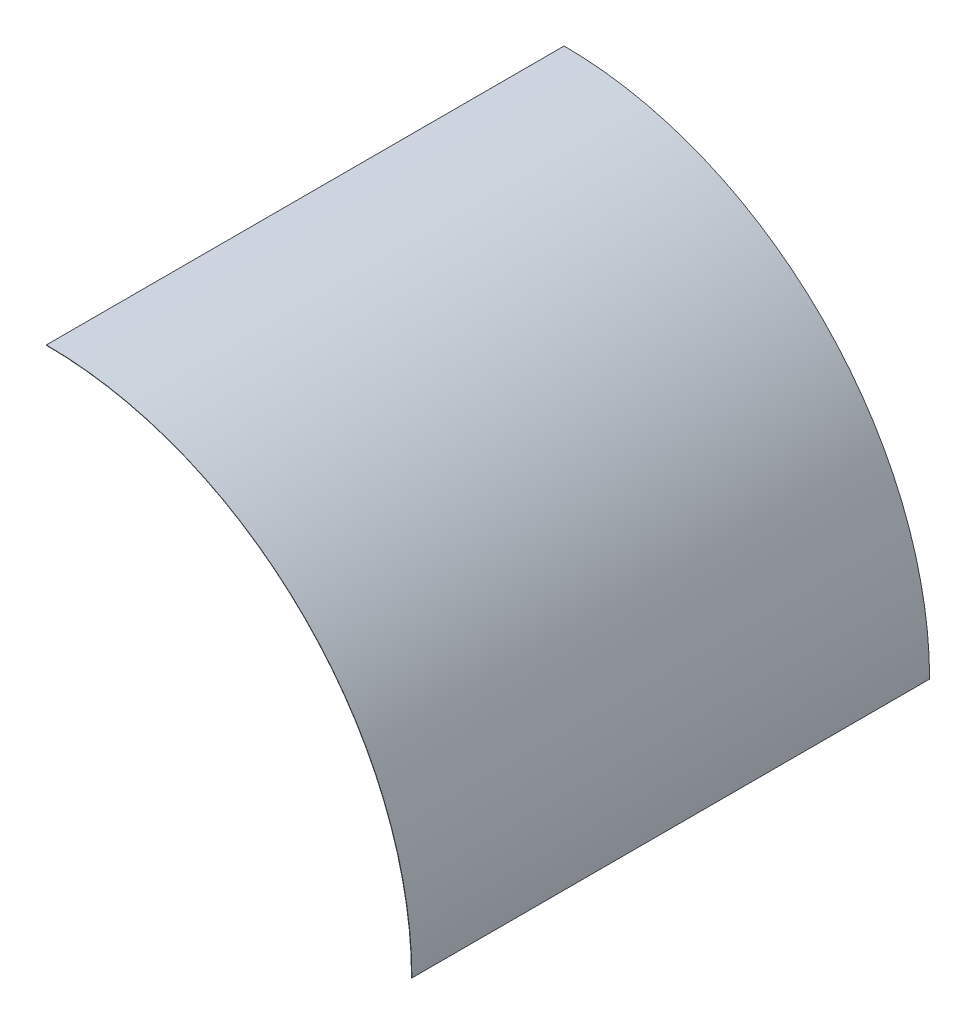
from build123d import *

# Parameters (mm, degrees)
BOSS_EXTRUDE1_DEPTH = 3000


with BuildPart() as part:
    # Sketch1 → Boss-Extrude1 (new body)
    with BuildSketch(Plane.XY):
        with BuildLine():
            Line((0, 2118), (0, 2116))
            ThreePointArc((0, 2116), (1496.237948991, 1496.237948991), (2116, 0))
            Line((2116, 0), (2118, 0))
            ThreePointArc((2118, 0), (1497.652162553, 1497.652162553), (0, 2118))
        make_face()
    extrude(amount=-BOSS_EXTRUDE1_DEPTH)


solid = part.part
